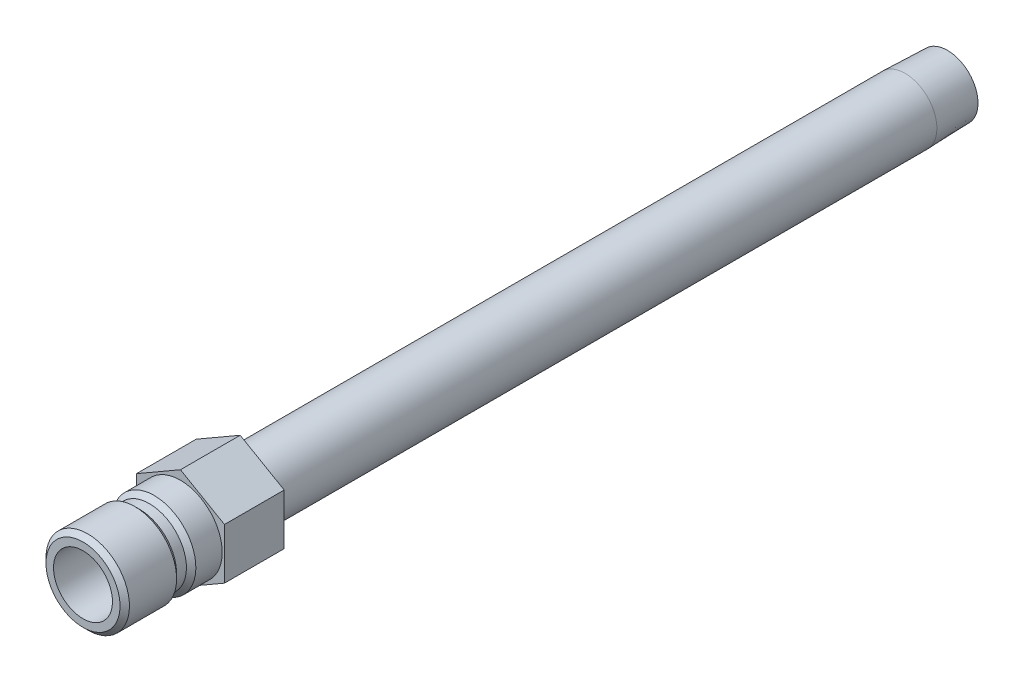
from build123d import *

# Parameters (mm, degrees)
SKETCH2_R           = 4.7625
BOSS_EXTRUDE1_DEPTH = 9.652


with BuildPart() as part:
    # Sketch1 → Revolve1 (revolve)
    with BuildSketch(Plane(origin=(0, 0, 0), x_dir=(0, 0, -1), z_dir=(1, 0, 0))):
        Polygon((-15.748, 4.7625), (-15.748, 5.9817), (-14.986, 6.7437), (-7.366, 6.7437), (-6.604, 5.9817), (-5.0165, 5.9817), (-4.2545, 6.7437), (9.652, 6.7437), (9.652, 5.1435), (117.094, 5.1435), (123.952, 4.929188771), (123.952, 3.4163), (-2.840212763, 3.4163), (-3.556, 4.7625), align=None)
    revolve(axis=Axis((0, 0, -9.652), (0, 0, 1)))

    # Sketch2 → Boss-Extrude1 (add)
    with BuildSketch(Plane.XY):
        Polygon((-7.112, 4.106115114), (-7.112, -4.106115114), (0, -8.212230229), (7.112, -4.106115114), (7.112, 4.106115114), (0, 8.212230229), align=None)
        with Locations(Location((0, 0, 0), (0, 0, 90))):
            Circle(SKETCH2_R, mode=Mode.SUBTRACT)
    extrude(amount=-BOSS_EXTRUDE1_DEPTH)


solid = part.part
